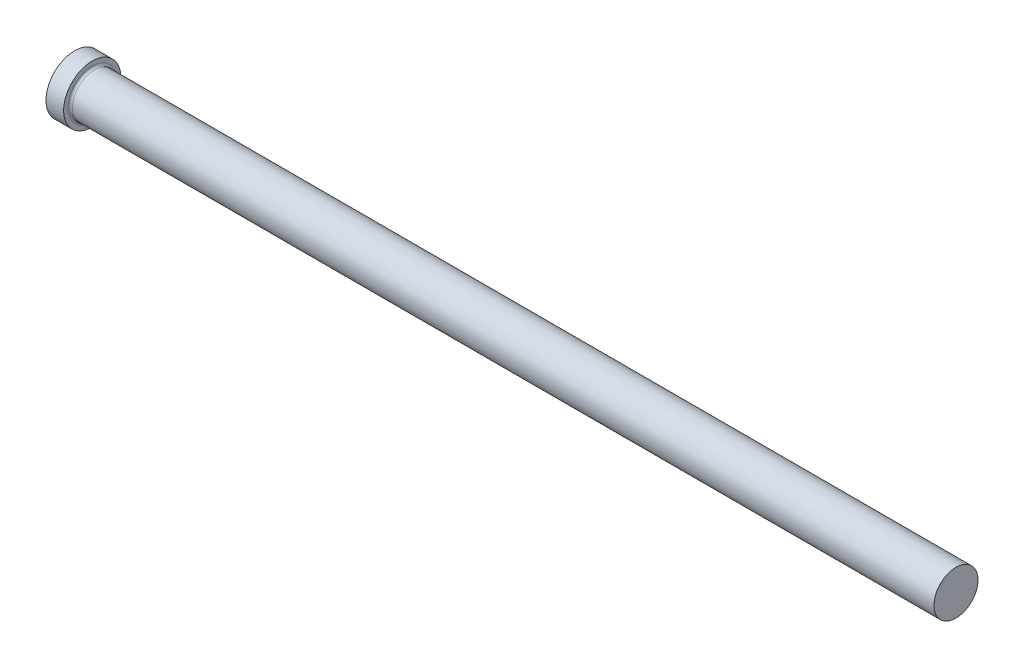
ISO-10303-21;
HEADER;
FILE_DESCRIPTION(('STEP AP214'),'2;1');
FILE_NAME('part.step','',(''),(''),'','','');
FILE_SCHEMA(('AUTOMOTIVE_DESIGN { 1 0 10303 214 1 1 1 1 }'));
ENDSEC;
DATA;
#1=APPLICATION_CONTEXT('core data for automotive mechanical design processes');
#2=APPLICATION_PROTOCOL_DEFINITION('international standard','automotive_design',2000,#1);
#3=PRODUCT_CONTEXT('',#1,'mechanical');
#4=PRODUCT('Part','Part','',(#3));
#5=PRODUCT_RELATED_PRODUCT_CATEGORY('part','',(#4));
#6=PRODUCT_DEFINITION_FORMATION('','',#4);
#7=PRODUCT_DEFINITION_CONTEXT('part definition',#1,'design');
#8=PRODUCT_DEFINITION('design','',#6,#7);
#9=PRODUCT_DEFINITION_SHAPE('','',#8);
#10=(LENGTH_UNIT() NAMED_UNIT(*) SI_UNIT(.MILLI.,.METRE.));
#11=(NAMED_UNIT(*) PLANE_ANGLE_UNIT() SI_UNIT($,.RADIAN.));
#12=(NAMED_UNIT(*) SI_UNIT($,.STERADIAN.) SOLID_ANGLE_UNIT());
#13=UNCERTAINTY_MEASURE_WITH_UNIT(LENGTH_MEASURE(1.E-05),#10,'distance_accuracy_value','');
#14=(GEOMETRIC_REPRESENTATION_CONTEXT(3) GLOBAL_UNCERTAINTY_ASSIGNED_CONTEXT((#13)) GLOBAL_UNIT_ASSIGNED_CONTEXT((#10,
#11,#12)) REPRESENTATION_CONTEXT('',''));
#15=CARTESIAN_POINT('',(0.,0.,0.));
#16=DIRECTION('',(0.,0.,1.));
#17=DIRECTION('',(1.,0.,0.));
#18=AXIS2_PLACEMENT_3D('',#15,#16,#17);
#19=CARTESIAN_POINT('',(0.,0.,0.));
#20=DIRECTION('',(-1.,0.,0.));
#21=DIRECTION('',(0.,-1.,0.));
#22=AXIS2_PLACEMENT_3D('',#19,#20,#21);
#23=PLANE('',#22);
#24=CARTESIAN_POINT('',(0.,0.,0.));
#25=DIRECTION('',(1.,0.,0.));
#26=DIRECTION('',(0.,1.,0.));
#27=AXIS2_PLACEMENT_3D('',#24,#25,#26);
#28=CIRCLE('',#27,13.);
#29=CARTESIAN_POINT('',(0.,13.,0.));
#30=VERTEX_POINT('',#29);
#31=EDGE_CURVE('E25',#30,#30,#28,.T.);
#32=ORIENTED_EDGE('',*,*,#31,.F.);
#33=EDGE_LOOP('',(#32));
#34=FACE_BOUND('',#33,.T.);
#35=ADVANCED_FACE('F14',(#34),#23,.T.);
#36=CARTESIAN_POINT('',(400.,0.,0.));
#37=DIRECTION('',(1.,0.,0.));
#38=DIRECTION('',(0.,1.,0.));
#39=AXIS2_PLACEMENT_3D('',#36,#37,#38);
#40=CYLINDRICAL_SURFACE('',#39,13.);
#41=ORIENTED_EDGE('',*,*,#31,.T.);
#42=EDGE_LOOP('',(#41));
#43=FACE_BOUND('',#42,.T.);
#44=CARTESIAN_POINT('',(8.,0.,0.));
#45=DIRECTION('',(1.,0.,0.));
#46=DIRECTION('',(0.,1.,0.));
#47=AXIS2_PLACEMENT_3D('',#44,#45,#46);
#48=CIRCLE('',#47,13.);
#49=CARTESIAN_POINT('',(8.,13.,0.));
#50=VERTEX_POINT('',#49);
#51=EDGE_CURVE('E29',#50,#50,#48,.T.);
#52=ORIENTED_EDGE('',*,*,#51,.F.);
#53=EDGE_LOOP('',(#52));
#54=FACE_BOUND('',#53,.T.);
#55=ADVANCED_FACE('F51',(#43,#54),#40,.T.);
#56=CARTESIAN_POINT('',(8.,13.,0.));
#57=DIRECTION('',(1.,0.,0.));
#58=DIRECTION('',(0.,1.,0.));
#59=AXIS2_PLACEMENT_3D('',#56,#57,#58);
#60=PLANE('',#59);
#61=CARTESIAN_POINT('',(8.,0.,0.));
#62=DIRECTION('',(1.,0.,0.));
#63=DIRECTION('',(0.,1.,0.));
#64=AXIS2_PLACEMENT_3D('',#61,#62,#63);
#65=CIRCLE('',#64,11.);
#66=CARTESIAN_POINT('',(8.,11.,0.));
#67=VERTEX_POINT('',#66);
#68=EDGE_CURVE('E9',#67,#67,#65,.F.);
#69=ORIENTED_EDGE('',*,*,#68,.T.);
#70=EDGE_LOOP('',(#69));
#71=FACE_BOUND('',#70,.T.);
#72=ORIENTED_EDGE('',*,*,#51,.T.);
#73=EDGE_LOOP('',(#72));
#74=FACE_BOUND('',#73,.T.);
#75=ADVANCED_FACE('F42',(#71,#74),#60,.T.);
#76=CARTESIAN_POINT('',(400.,0.,0.));
#77=DIRECTION('',(1.,0.,0.));
#78=DIRECTION('',(0.,1.,0.));
#79=AXIS2_PLACEMENT_3D('',#76,#77,#78);
#80=CYLINDRICAL_SURFACE('',#79,10.);
#81=CARTESIAN_POINT('',(9.,0.,0.));
#82=DIRECTION('',(1.,0.,0.));
#83=DIRECTION('',(0.,1.,0.));
#84=AXIS2_PLACEMENT_3D('',#81,#82,#83);
#85=CIRCLE('',#84,10.);
#86=CARTESIAN_POINT('',(9.,10.,0.));
#87=VERTEX_POINT('',#86);
#88=EDGE_CURVE('E21',#87,#87,#85,.T.);
#89=ORIENTED_EDGE('',*,*,#88,.T.);
#90=EDGE_LOOP('',(#89));
#91=FACE_BOUND('',#90,.T.);
#92=CARTESIAN_POINT('',(400.,0.,0.));
#93=DIRECTION('',(1.,0.,0.));
#94=DIRECTION('',(0.,1.,0.));
#95=AXIS2_PLACEMENT_3D('',#92,#93,#94);
#96=CIRCLE('',#95,10.);
#97=CARTESIAN_POINT('',(400.,10.,0.));
#98=VERTEX_POINT('',#97);
#99=EDGE_CURVE('E34',#98,#98,#96,.T.);
#100=ORIENTED_EDGE('',*,*,#99,.F.);
#101=EDGE_LOOP('',(#100));
#102=FACE_BOUND('',#101,.T.);
#103=ADVANCED_FACE('F40',(#91,#102),#80,.T.);
#104=CARTESIAN_POINT('',(400.,10.,0.));
#105=DIRECTION('',(1.,0.,0.));
#106=DIRECTION('',(0.,1.,0.));
#107=AXIS2_PLACEMENT_3D('',#104,#105,#106);
#108=PLANE('',#107);
#109=ORIENTED_EDGE('',*,*,#99,.T.);
#110=EDGE_LOOP('',(#109));
#111=FACE_BOUND('',#110,.T.);
#112=ADVANCED_FACE('F38',(#111),#108,.T.);
#113=CARTESIAN_POINT('',(9.,0.,0.));
#114=DIRECTION('',(1.,0.,0.));
#115=DIRECTION('',(0.,1.,0.));
#116=AXIS2_PLACEMENT_3D('',#113,#114,#115);
#117=TOROIDAL_SURFACE('',#116,11.,1.);
#118=ORIENTED_EDGE('',*,*,#68,.F.);
#119=EDGE_LOOP('',(#118));
#120=FACE_BOUND('',#119,.T.);
#121=ORIENTED_EDGE('',*,*,#88,.F.);
#122=EDGE_LOOP('',(#121));
#123=FACE_BOUND('',#122,.T.);
#124=ADVANCED_FACE('F16',(#120,#123),#117,.F.);
#125=CLOSED_SHELL('',(#35,#55,#75,#103,#112,#124));
#126=MANIFOLD_SOLID_BREP('B1',#125);
#127=ADVANCED_BREP_SHAPE_REPRESENTATION('',(#18,#126),#14);
#128=SHAPE_DEFINITION_REPRESENTATION(#9,#127);
ENDSEC;
END-ISO-10303-21;
